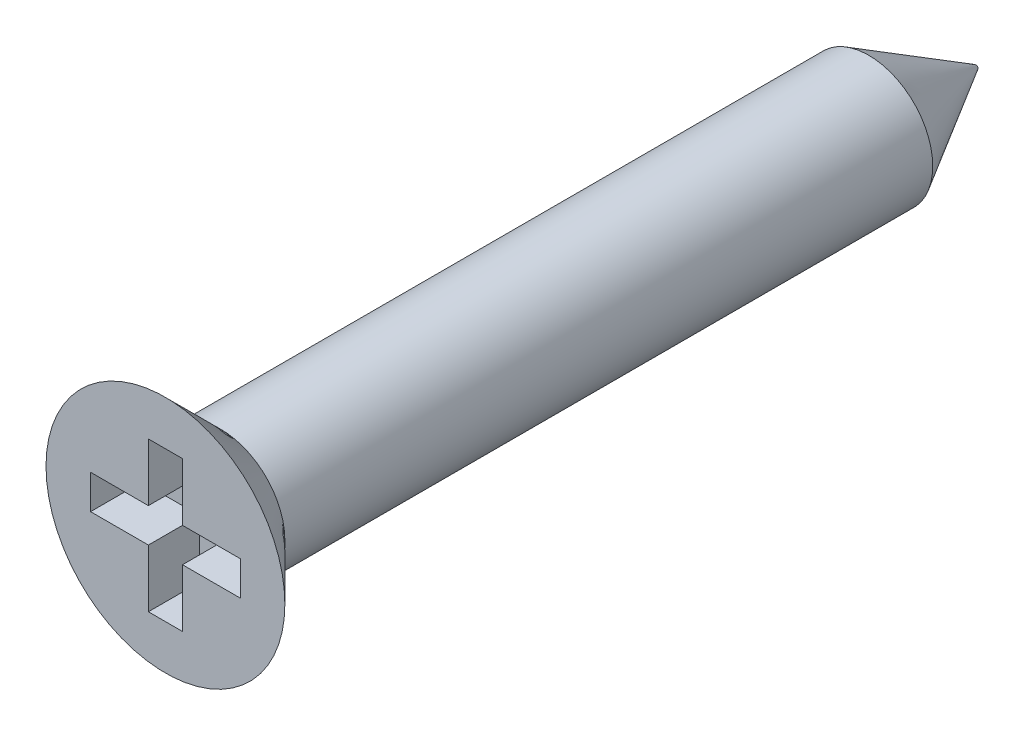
from build123d import *

# Parameters (mm, degrees)
ESQUISSE3_R             = 1.5
EXTRUSION1_DEPTH        = 19
ENL_V_MAT_EXTRU_2_DEPTH = 1.2
CHANFREIN1_SIZE         = 1.45
CHANFREIN1_SIZE2        = 2.511473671


with BuildPart() as part:
    # Esquisse1 → R_volution2 (revolve)
    with BuildSketch(Plane(origin=(0, 0, 0), x_dir=(0, 0, -1), z_dir=(1, 0, 0)), mode=Mode.PRIVATE) as r_volution2_sk:
        Polygon((0, 2.8), (1.3, 1.5), (1.3, 0), (0, 0), align=None)
    revolve(r_volution2_sk.sketch.rotate(Axis((0, 0, 1.603508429), (0, 0, -1)), 90), axis=Axis((0, 0, 1.603508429), (0, 0, -1)))

    # Esquisse3 → Extrusion1 (add)
    with BuildSketch(Plane.XY):
        Circle(ESQUISSE3_R)
    extrude(amount=-EXTRUSION1_DEPTH)

    # Esquisse2 → Enl_v. mat.-Extru.2 (cut)
    with BuildSketch(Plane.XY):
        Polygon((0.4, -0.4), (1.754992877, -0.4), (1.754992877, 0.4), (0.4, 0.4), (0.4, 1.754992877), (-0.4, 1.754992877), (-0.4, 0.4), (-1.754992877, 0.4), (-1.754992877, -0.4), (-0.4, -0.4), (-0.4, -1.754992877), (0.4, -1.754992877), align=None)
    extrude(amount=-ENL_V_MAT_EXTRU_2_DEPTH, mode=Mode.SUBTRACT)

    # Chanfrein1
    chanfrein1_edges = [part.edges().sort_by_distance(p)[0] for p in [
        (-1.5, 0, -19),
    ]]
    chanfrein1_side = [part.faces().sort_by_distance(p)[0] for p in [
        (0, 0, -19),
    ]]
    chamfer(chanfrein1_edges, length=CHANFREIN1_SIZE, length2=CHANFREIN1_SIZE2, reference=chanfrein1_side[0])


solid = part.part
